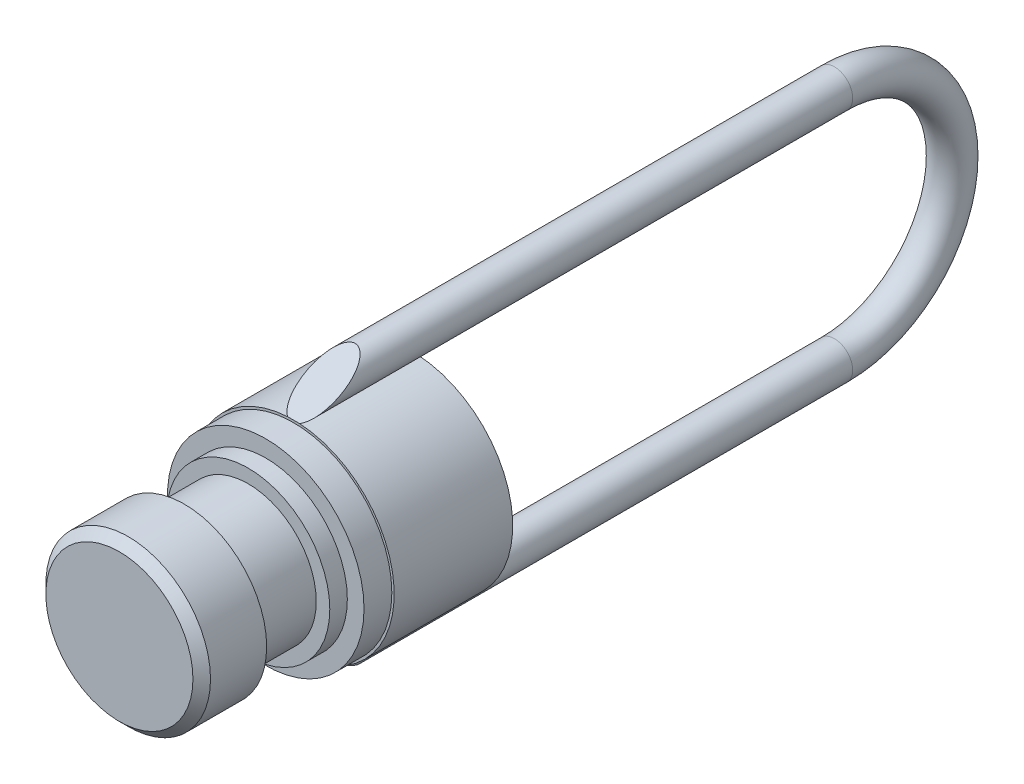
ISO-10303-21;
HEADER;
FILE_DESCRIPTION(('STEP AP214'),'2;1');
FILE_NAME('part.step','',(''),(''),'','','');
FILE_SCHEMA(('AUTOMOTIVE_DESIGN { 1 0 10303 214 1 1 1 1 }'));
ENDSEC;
DATA;
#1=APPLICATION_CONTEXT('core data for automotive mechanical design processes');
#2=APPLICATION_PROTOCOL_DEFINITION('international standard','automotive_design',2000,#1);
#3=PRODUCT_CONTEXT('',#1,'mechanical');
#4=PRODUCT('Part','Part','',(#3));
#5=PRODUCT_RELATED_PRODUCT_CATEGORY('part','',(#4));
#6=PRODUCT_DEFINITION_FORMATION('','',#4);
#7=PRODUCT_DEFINITION_CONTEXT('part definition',#1,'design');
#8=PRODUCT_DEFINITION('design','',#6,#7);
#9=PRODUCT_DEFINITION_SHAPE('','',#8);
#10=(LENGTH_UNIT() NAMED_UNIT(*) SI_UNIT(.MILLI.,.METRE.));
#11=(NAMED_UNIT(*) PLANE_ANGLE_UNIT() SI_UNIT($,.RADIAN.));
#12=(NAMED_UNIT(*) SI_UNIT($,.STERADIAN.) SOLID_ANGLE_UNIT());
#13=UNCERTAINTY_MEASURE_WITH_UNIT(LENGTH_MEASURE(1.E-05),#10,'distance_accuracy_value','');
#14=(GEOMETRIC_REPRESENTATION_CONTEXT(3) GLOBAL_UNCERTAINTY_ASSIGNED_CONTEXT((#13)) GLOBAL_UNIT_ASSIGNED_CONTEXT((#10,
#11,#12)) REPRESENTATION_CONTEXT('',''));
#15=CARTESIAN_POINT('',(0.,0.,0.));
#16=DIRECTION('',(0.,0.,1.));
#17=DIRECTION('',(1.,0.,0.));
#18=AXIS2_PLACEMENT_3D('',#15,#16,#17);
#19=CARTESIAN_POINT('',(0.,0.,-50.8));
#20=DIRECTION('',(0.,0.,1.));
#21=DIRECTION('',(1.,0.,0.));
#22=AXIS2_PLACEMENT_3D('',#19,#20,#21);
#23=PLANE('',#22);
#24=CARTESIAN_POINT('',(0.,-20.433149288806,-50.8));
#25=DIRECTION('',(0.,0.,1.));
#26=DIRECTION('',(1.,0.,0.));
#27=AXIS2_PLACEMENT_3D('',#24,#25,#26);
#28=CIRCLE('',#27,3.175);
#29=CARTESIAN_POINT('',(-1.03553876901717,-17.4317688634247,-50.8));
#30=VERTEX_POINT('',#29);
#31=CARTESIAN_POINT('',(1.03553876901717,-17.4317688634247,-50.8));
#32=VERTEX_POINT('',#31);
#33=EDGE_CURVE('E46',#30,#32,#28,.F.);
#34=ORIENTED_EDGE('',*,*,#33,.F.);
#35=CARTESIAN_POINT('',(0.,0.,-50.8));
#36=DIRECTION('',(0.,0.,1.));
#37=DIRECTION('',(1.,0.,0.));
#38=AXIS2_PLACEMENT_3D('',#35,#36,#37);
#39=CIRCLE('',#38,17.4625);
#40=CARTESIAN_POINT('',(-1.03553876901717,17.4317688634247,-50.8));
#41=VERTEX_POINT('',#40);
#42=EDGE_CURVE('E102',#41,#30,#39,.T.);
#43=ORIENTED_EDGE('',*,*,#42,.F.);
#44=CARTESIAN_POINT('',(0.,20.433149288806,-50.8));
#45=DIRECTION('',(0.,0.,1.));
#46=DIRECTION('',(1.,0.,0.));
#47=AXIS2_PLACEMENT_3D('',#44,#45,#46);
#48=CIRCLE('',#47,3.175);
#49=CARTESIAN_POINT('',(1.03553876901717,17.4317688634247,-50.8));
#50=VERTEX_POINT('',#49);
#51=EDGE_CURVE('E128',#41,#50,#48,.T.);
#52=ORIENTED_EDGE('',*,*,#51,.T.);
#53=EDGE_CURVE('E95',#32,#50,#39,.T.);
#54=ORIENTED_EDGE('',*,*,#53,.F.);
#55=EDGE_LOOP('',(#34,#43,#52,#54));
#56=FACE_BOUND('',#55,.T.);
#57=ADVANCED_FACE('F31',(#56),#23,.F.);
#58=CARTESIAN_POINT('',(0.,0.,-50.8));
#59=DIRECTION('',(0.,0.,1.));
#60=DIRECTION('',(1.,0.,0.));
#61=AXIS2_PLACEMENT_3D('',#58,#59,#60);
#62=CYLINDRICAL_SURFACE('',#61,17.4625);
#63=CARTESIAN_POINT('',(0.,0.,-30.226));
#64=DIRECTION('',(0.,0.,1.));
#65=DIRECTION('',(1.,0.,0.));
#66=AXIS2_PLACEMENT_3D('',#63,#64,#65);
#67=CIRCLE('',#66,17.4625);
#68=CARTESIAN_POINT('',(1.03553876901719,-17.4317688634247,-30.226));
#69=VERTEX_POINT('',#68);
#70=CARTESIAN_POINT('',(1.03553876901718,17.4317688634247,-30.226));
#71=VERTEX_POINT('',#70);
#72=EDGE_CURVE('E79',#69,#71,#67,.T.);
#73=ORIENTED_EDGE('',*,*,#72,.F.);
#74=DIRECTION('',(0.,0.,1.));
#75=VECTOR('',#74,1.);
#76=CARTESIAN_POINT('',(1.03553876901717,-17.4317688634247,-77.159425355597));
#77=LINE('',#76,#75);
#78=EDGE_CURVE('E84',#69,#32,#77,.F.);
#79=ORIENTED_EDGE('',*,*,#78,.T.);
#80=ORIENTED_EDGE('',*,*,#53,.T.);
#81=DIRECTION('',(0.,0.,1.));
#82=VECTOR('',#81,1.);
#83=CARTESIAN_POINT('',(1.03553876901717,17.4317688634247,-77.159425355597));
#84=LINE('',#83,#82);
#85=EDGE_CURVE('E92',#71,#50,#84,.F.);
#86=ORIENTED_EDGE('',*,*,#85,.F.);
#87=EDGE_LOOP('',(#73,#79,#80,#86));
#88=FACE_BOUND('',#87,.T.);
#89=ADVANCED_FACE('F33',(#88),#62,.T.);
#90=ORIENTED_EDGE('',*,*,#42,.T.);
#91=DIRECTION('',(0.,0.,1.));
#92=VECTOR('',#91,1.);
#93=CARTESIAN_POINT('',(-1.03553876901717,-17.4317688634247,-77.159425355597));
#94=LINE('',#93,#92);
#95=CARTESIAN_POINT('',(-1.03553876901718,-17.4317688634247,-30.226));
#96=VERTEX_POINT('',#95);
#97=EDGE_CURVE('E50',#30,#96,#94,.T.);
#98=ORIENTED_EDGE('',*,*,#97,.T.);
#99=CARTESIAN_POINT('',(-1.03553876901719,17.4317688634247,-30.226));
#100=VERTEX_POINT('',#99);
#101=EDGE_CURVE('E81',#100,#96,#67,.T.);
#102=ORIENTED_EDGE('',*,*,#101,.F.);
#103=DIRECTION('',(0.,0.,1.));
#104=VECTOR('',#103,1.);
#105=CARTESIAN_POINT('',(-1.03553876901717,17.4317688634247,-77.159425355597));
#106=LINE('',#105,#104);
#107=EDGE_CURVE('E115',#41,#100,#106,.T.);
#108=ORIENTED_EDGE('',*,*,#107,.F.);
#109=EDGE_LOOP('',(#90,#98,#102,#108));
#110=FACE_BOUND('',#109,.T.);
#111=ADVANCED_FACE('F132',(#110),#62,.T.);
#112=CARTESIAN_POINT('',(0.,0.,2.05945945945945));
#113=DIRECTION('',(0.,0.,1.));
#114=DIRECTION('',(1.,0.,0.));
#115=AXIS2_PLACEMENT_3D('',#112,#113,#114);
#116=CYLINDRICAL_SURFACE('',#115,14.1605);
#117=CARTESIAN_POINT('',(0.,0.,-25.4));
#118=DIRECTION('',(0.,0.,1.));
#119=DIRECTION('',(1.,0.,0.));
#120=AXIS2_PLACEMENT_3D('',#117,#118,#119);
#121=CIRCLE('',#120,14.1605);
#122=CARTESIAN_POINT('',(14.1605,0.,-25.4));
#123=VERTEX_POINT('',#122);
#124=EDGE_CURVE('E106',#123,#123,#121,.T.);
#125=ORIENTED_EDGE('',*,*,#124,.T.);
#126=EDGE_LOOP('',(#125));
#127=FACE_BOUND('',#126,.T.);
#128=CARTESIAN_POINT('',(0.,0.,-22.352));
#129=DIRECTION('',(0.,0.,1.));
#130=DIRECTION('',(1.,0.,0.));
#131=AXIS2_PLACEMENT_3D('',#128,#129,#130);
#132=CIRCLE('',#131,14.1605);
#133=CARTESIAN_POINT('',(14.1605,0.,-22.352));
#134=VERTEX_POINT('',#133);
#135=EDGE_CURVE('E103',#134,#134,#132,.F.);
#136=ORIENTED_EDGE('',*,*,#135,.T.);
#137=EDGE_LOOP('',(#136));
#138=FACE_BOUND('',#137,.T.);
#139=ADVANCED_FACE('F164',(#127,#138),#116,.T.);
#140=CARTESIAN_POINT('',(0.,17.4625,-30.226));
#141=DIRECTION('',(0.,0.,1.));
#142=DIRECTION('',(1.,0.,0.));
#143=AXIS2_PLACEMENT_3D('',#140,#141,#142);
#144=PLANE('',#143);
#145=DIRECTION('',(1.,0.,0.));
#146=VECTOR('',#145,1.);
#147=CARTESIAN_POINT('',(-3.81,-17.4317688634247,-30.226));
#148=LINE('',#147,#146);
#149=EDGE_CURVE('E71',#96,#69,#148,.T.);
#150=ORIENTED_EDGE('',*,*,#149,.T.);
#151=ORIENTED_EDGE('',*,*,#72,.T.);
#152=DIRECTION('',(1.,0.,0.));
#153=VECTOR('',#152,1.);
#154=CARTESIAN_POINT('',(-3.81,17.4317688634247,-30.226));
#155=LINE('',#154,#153);
#156=EDGE_CURVE('E82',#100,#71,#155,.T.);
#157=ORIENTED_EDGE('',*,*,#156,.F.);
#158=ORIENTED_EDGE('',*,*,#101,.T.);
#159=EDGE_LOOP('',(#150,#151,#157,#158));
#160=FACE_BOUND('',#159,.T.);
#161=CARTESIAN_POINT('',(0.,0.,-30.226));
#162=DIRECTION('',(0.,0.,1.));
#163=DIRECTION('',(1.,0.,0.));
#164=AXIS2_PLACEMENT_3D('',#161,#162,#163);
#165=CIRCLE('',#164,17.0561);
#166=CARTESIAN_POINT('',(17.0561,0.,-30.226));
#167=VERTEX_POINT('',#166);
#168=EDGE_CURVE('E93',#167,#167,#165,.T.);
#169=ORIENTED_EDGE('',*,*,#168,.F.);
#170=EDGE_LOOP('',(#169));
#171=FACE_BOUND('',#170,.T.);
#172=ADVANCED_FACE('F75',(#160,#171),#144,.T.);
#173=CARTESIAN_POINT('',(0.,0.,2.05945945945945));
#174=DIRECTION('',(0.,0.,1.));
#175=DIRECTION('',(1.,0.,0.));
#176=AXIS2_PLACEMENT_3D('',#173,#174,#175);
#177=CYLINDRICAL_SURFACE('',#176,17.0561);
#178=ORIENTED_EDGE('',*,*,#168,.T.);
#179=EDGE_LOOP('',(#178));
#180=FACE_BOUND('',#179,.T.);
#181=CARTESIAN_POINT('',(0.,0.,-25.4));
#182=DIRECTION('',(0.,0.,1.));
#183=DIRECTION('',(1.,0.,0.));
#184=AXIS2_PLACEMENT_3D('',#181,#182,#183);
#185=CIRCLE('',#184,17.0561);
#186=CARTESIAN_POINT('',(17.0561,0.,-25.4));
#187=VERTEX_POINT('',#186);
#188=EDGE_CURVE('E97',#187,#187,#185,.T.);
#189=ORIENTED_EDGE('',*,*,#188,.F.);
#190=EDGE_LOOP('',(#189));
#191=FACE_BOUND('',#190,.T.);
#192=ADVANCED_FACE('F154',(#180,#191),#177,.T.);
#193=CARTESIAN_POINT('',(0.,17.0561,-25.4));
#194=DIRECTION('',(0.,0.,1.));
#195=DIRECTION('',(1.,0.,0.));
#196=AXIS2_PLACEMENT_3D('',#193,#194,#195);
#197=PLANE('',#196);
#198=ORIENTED_EDGE('',*,*,#188,.T.);
#199=EDGE_LOOP('',(#198));
#200=FACE_BOUND('',#199,.T.);
#201=ORIENTED_EDGE('',*,*,#124,.F.);
#202=EDGE_LOOP('',(#201));
#203=FACE_BOUND('',#202,.T.);
#204=ADVANCED_FACE('F151',(#200,#203),#197,.T.);
#205=CARTESIAN_POINT('',(0.,0.,7.83379150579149));
#206=DIRECTION('',(0.,0.,1.));
#207=DIRECTION('',(1.,0.,0.));
#208=AXIS2_PLACEMENT_3D('',#205,#206,#207);
#209=CYLINDRICAL_SURFACE('',#208,11.811);
#210=CARTESIAN_POINT('',(0.,0.,-22.352));
#211=DIRECTION('',(0.,0.,1.));
#212=DIRECTION('',(1.,0.,0.));
#213=AXIS2_PLACEMENT_3D('',#210,#211,#212);
#214=CIRCLE('',#213,11.811);
#215=CARTESIAN_POINT('',(11.811,0.,-22.352));
#216=VERTEX_POINT('',#215);
#217=EDGE_CURVE('E134',#216,#216,#214,.T.);
#218=ORIENTED_EDGE('',*,*,#217,.T.);
#219=EDGE_LOOP('',(#218));
#220=FACE_BOUND('',#219,.T.);
#221=CARTESIAN_POINT('',(0.,0.,-12.7));
#222=DIRECTION('',(0.,0.,1.));
#223=DIRECTION('',(1.,0.,0.));
#224=AXIS2_PLACEMENT_3D('',#221,#222,#223);
#225=CIRCLE('',#224,11.811);
#226=CARTESIAN_POINT('',(11.811,0.,-12.7));
#227=VERTEX_POINT('',#226);
#228=EDGE_CURVE('E107',#227,#227,#225,.T.);
#229=ORIENTED_EDGE('',*,*,#228,.F.);
#230=EDGE_LOOP('',(#229));
#231=FACE_BOUND('',#230,.T.);
#232=ADVANCED_FACE('F162',(#220,#231),#209,.T.);
#233=CARTESIAN_POINT('',(0.,0.,-11.2701920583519));
#234=DIRECTION('',(0.,0.,1.));
#235=DIRECTION('',(1.,0.,0.));
#236=AXIS2_PLACEMENT_3D('',#233,#234,#235);
#237=CONICAL_SURFACE('',#236,14.2875,1.0471975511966);
#238=ORIENTED_EDGE('',*,*,#228,.T.);
#239=EDGE_LOOP('',(#238));
#240=FACE_BOUND('',#239,.T.);
#241=CARTESIAN_POINT('',(0.,0.,-11.2701920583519));
#242=DIRECTION('',(0.,0.,1.));
#243=DIRECTION('',(1.,0.,0.));
#244=AXIS2_PLACEMENT_3D('',#241,#242,#243);
#245=CIRCLE('',#244,14.2875);
#246=CARTESIAN_POINT('',(14.2875,0.,-11.2701920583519));
#247=VERTEX_POINT('',#246);
#248=EDGE_CURVE('E137',#247,#247,#245,.T.);
#249=ORIENTED_EDGE('',*,*,#248,.F.);
#250=EDGE_LOOP('',(#249));
#251=FACE_BOUND('',#250,.T.);
#252=ADVANCED_FACE('F190',(#240,#251),#237,.T.);
#253=CARTESIAN_POINT('',(0.,0.,7.83379150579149));
#254=DIRECTION('',(0.,0.,1.));
#255=DIRECTION('',(1.,0.,0.));
#256=AXIS2_PLACEMENT_3D('',#253,#254,#255);
#257=CYLINDRICAL_SURFACE('',#256,14.2875);
#258=CARTESIAN_POINT('',(0.,0.,-1.52400000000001));
#259=DIRECTION('',(0.,0.,1.));
#260=DIRECTION('',(1.,0.,0.));
#261=AXIS2_PLACEMENT_3D('',#258,#259,#260);
#262=CIRCLE('',#261,14.2875);
#263=CARTESIAN_POINT('',(14.2875,0.,-1.52400000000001));
#264=VERTEX_POINT('',#263);
#265=EDGE_CURVE('E111',#264,#264,#262,.F.);
#266=ORIENTED_EDGE('',*,*,#265,.T.);
#267=EDGE_LOOP('',(#266));
#268=FACE_BOUND('',#267,.T.);
#269=ORIENTED_EDGE('',*,*,#248,.T.);
#270=EDGE_LOOP('',(#269));
#271=FACE_BOUND('',#270,.T.);
#272=ADVANCED_FACE('F182',(#268,#271),#257,.T.);
#273=CARTESIAN_POINT('',(0.,11.811,-22.352));
#274=DIRECTION('',(0.,0.,1.));
#275=DIRECTION('',(1.,0.,0.));
#276=AXIS2_PLACEMENT_3D('',#273,#274,#275);
#277=PLANE('',#276);
#278=ORIENTED_EDGE('',*,*,#135,.F.);
#279=EDGE_LOOP('',(#278));
#280=FACE_BOUND('',#279,.T.);
#281=ORIENTED_EDGE('',*,*,#217,.F.);
#282=EDGE_LOOP('',(#281));
#283=FACE_BOUND('',#282,.T.);
#284=ADVANCED_FACE('F174',(#280,#283),#277,.T.);
#285=CARTESIAN_POINT('',(0.,0.,0.));
#286=DIRECTION('',(0.,0.,1.));
#287=DIRECTION('',(1.,0.,0.));
#288=AXIS2_PLACEMENT_3D('',#285,#286,#287);
#289=PLANE('',#288);
#290=CARTESIAN_POINT('',(0.,0.,0.));
#291=DIRECTION('',(0.,0.,1.));
#292=DIRECTION('',(1.,0.,0.));
#293=AXIS2_PLACEMENT_3D('',#290,#291,#292);
#294=CIRCLE('',#293,12.7635);
#295=CARTESIAN_POINT('',(12.7635,0.,0.));
#296=VERTEX_POINT('',#295);
#297=EDGE_CURVE('E108',#296,#296,#294,.T.);
#298=ORIENTED_EDGE('',*,*,#297,.T.);
#299=EDGE_LOOP('',(#298));
#300=FACE_BOUND('',#299,.T.);
#301=ADVANCED_FACE('F171',(#300),#289,.T.);
#302=CARTESIAN_POINT('',(0.,0.,0.));
#303=DIRECTION('',(0.,0.,-1.));
#304=DIRECTION('',(-1.,0.,0.));
#305=AXIS2_PLACEMENT_3D('',#302,#303,#304);
#306=CONICAL_SURFACE('',#305,12.7635,0.785398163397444);
#307=ORIENTED_EDGE('',*,*,#265,.F.);
#308=EDGE_LOOP('',(#307));
#309=FACE_BOUND('',#308,.T.);
#310=ORIENTED_EDGE('',*,*,#297,.F.);
#311=EDGE_LOOP('',(#310));
#312=FACE_BOUND('',#311,.T.);
#313=ADVANCED_FACE('F173',(#309,#312),#306,.T.);
#314=CARTESIAN_POINT('',(0.,-20.433149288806,-124.092850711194));
#315=DIRECTION('',(0.,0.,1.));
#316=DIRECTION('',(0.,-1.,0.));
#317=AXIS2_PLACEMENT_3D('',#314,#315,#316);
#318=CYLINDRICAL_SURFACE('',#317,3.175);
#319=ORIENTED_EDGE('',*,*,#78,.F.);
#320=CARTESIAN_POINT('',(0.,-20.433149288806,-35.4245433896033));
#321=DIRECTION('',(0.,0.866025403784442,-0.499999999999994));
#322=DIRECTION('',(0.,0.499999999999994,0.866025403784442));
#323=AXIS2_PLACEMENT_3D('',#320,#321,#322);
#324=ELLIPSE('',#323,6.35000000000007,3.175);
#325=EDGE_CURVE('E11',#69,#96,#324,.T.);
#326=ORIENTED_EDGE('',*,*,#325,.T.);
#327=ORIENTED_EDGE('',*,*,#97,.F.);
#328=ORIENTED_EDGE('',*,*,#33,.T.);
#329=EDGE_LOOP('',(#319,#326,#327,#328));
#330=FACE_BOUND('',#329,.T.);
#331=CARTESIAN_POINT('',(0.,-20.433149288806,-124.092850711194));
#332=DIRECTION('',(0.,0.,-1.));
#333=DIRECTION('',(1.,0.,0.));
#334=AXIS2_PLACEMENT_3D('',#331,#332,#333);
#335=CIRCLE('',#334,3.175);
#336=CARTESIAN_POINT('',(0.,-23.608149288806,-124.092850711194));
#337=VERTEX_POINT('',#336);
#338=EDGE_CURVE('E139',#337,#337,#335,.T.);
#339=ORIENTED_EDGE('',*,*,#338,.F.);
#340=EDGE_LOOP('',(#339));
#341=FACE_BOUND('',#340,.T.);
#342=ADVANCED_FACE('F85',(#330,#341),#318,.T.);
#343=CARTESIAN_POINT('',(0.,0.,-124.092850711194));
#344=DIRECTION('',(-1.,0.,0.));
#345=DIRECTION('',(0.,0.,1.));
#346=AXIS2_PLACEMENT_3D('',#343,#344,#345);
#347=TOROIDAL_SURFACE('',#346,20.433149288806,3.175);
#348=CARTESIAN_POINT('',(0.,20.433149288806,-124.092850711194));
#349=DIRECTION('',(0.,0.,1.));
#350=DIRECTION('',(1.,0.,0.));
#351=AXIS2_PLACEMENT_3D('',#348,#349,#350);
#352=CIRCLE('',#351,3.175);
#353=CARTESIAN_POINT('',(0.,23.608149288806,-124.092850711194));
#354=VERTEX_POINT('',#353);
#355=EDGE_CURVE('E122',#354,#354,#352,.T.);
#356=CARTESIAN_POINT('',(0.,0.,-124.092850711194));
#357=DIRECTION('',(-1.,0.,0.));
#358=DIRECTION('',(0.,0.,1.));
#359=AXIS2_PLACEMENT_3D('',#356,#357,#358);
#360=CIRCLE('',#359,23.608149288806);
#361=EDGE_CURVE('',#354,#337,#360,.T.);
#362=ORIENTED_EDGE('',*,*,#355,.F.);
#363=ORIENTED_EDGE('',*,*,#338,.T.);
#364=ORIENTED_EDGE('',*,*,#361,.T.);
#365=ORIENTED_EDGE('',*,*,#361,.F.);
#366=EDGE_LOOP('',(#362,#364,#363,#365));
#367=FACE_BOUND('',#366,.T.);
#368=ADVANCED_FACE('F223',(#367),#347,.T.);
#369=CARTESIAN_POINT('',(0.,20.433149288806,-124.092850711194));
#370=DIRECTION('',(0.,0.,1.));
#371=DIRECTION('',(0.,-1.,0.));
#372=AXIS2_PLACEMENT_3D('',#369,#370,#371);
#373=CYLINDRICAL_SURFACE('',#372,3.175);
#374=CARTESIAN_POINT('',(0.,20.433149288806,-35.4245433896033));
#375=DIRECTION('',(0.,-0.866025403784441,-0.499999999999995));
#376=DIRECTION('',(0.,-0.499999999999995,0.866025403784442));
#377=AXIS2_PLACEMENT_3D('',#374,#375,#376);
#378=ELLIPSE('',#377,6.35000000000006,3.175);
#379=EDGE_CURVE('E39',#71,#100,#378,.F.);
#380=ORIENTED_EDGE('',*,*,#379,.F.);
#381=ORIENTED_EDGE('',*,*,#85,.T.);
#382=ORIENTED_EDGE('',*,*,#51,.F.);
#383=ORIENTED_EDGE('',*,*,#107,.T.);
#384=EDGE_LOOP('',(#380,#381,#382,#383));
#385=FACE_BOUND('',#384,.T.);
#386=ORIENTED_EDGE('',*,*,#355,.T.);
#387=EDGE_LOOP('',(#386));
#388=FACE_BOUND('',#387,.T.);
#389=ADVANCED_FACE('F125',(#385,#388),#373,.T.);
#390=CARTESIAN_POINT('',(-3.81,17.4317688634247,-30.226));
#391=DIRECTION('',(0.,-0.866025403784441,-0.499999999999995));
#392=DIRECTION('',(0.,0.499999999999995,-0.866025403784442));
#393=AXIS2_PLACEMENT_3D('',#390,#391,#392);
#394=PLANE('',#393);
#395=ORIENTED_EDGE('',*,*,#156,.T.);
#396=ORIENTED_EDGE('',*,*,#379,.T.);
#397=EDGE_LOOP('',(#395,#396));
#398=FACE_BOUND('',#397,.T.);
#399=ADVANCED_FACE('F120',(#398),#394,.F.);
#400=CARTESIAN_POINT('',(-3.81,-17.4317688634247,-30.226));
#401=DIRECTION('',(0.,0.866025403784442,-0.499999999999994));
#402=DIRECTION('',(0.,0.499999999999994,0.866025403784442));
#403=AXIS2_PLACEMENT_3D('',#400,#401,#402);
#404=PLANE('',#403);
#405=ORIENTED_EDGE('',*,*,#149,.F.);
#406=ORIENTED_EDGE('',*,*,#325,.F.);
#407=EDGE_LOOP('',(#405,#406));
#408=FACE_BOUND('',#407,.T.);
#409=ADVANCED_FACE('F70',(#408),#404,.F.);
#410=CLOSED_SHELL('',(#57,#89,#111,#139,#172,#192,#204,#232,#252,#272,#284,#301,#313,#342,#368,
#389,#399,#409));
#411=MANIFOLD_SOLID_BREP('B2',#410);
#412=ADVANCED_BREP_SHAPE_REPRESENTATION('',(#18,#411),#14);
#413=SHAPE_DEFINITION_REPRESENTATION(#9,#412);
ENDSEC;
END-ISO-10303-21;
